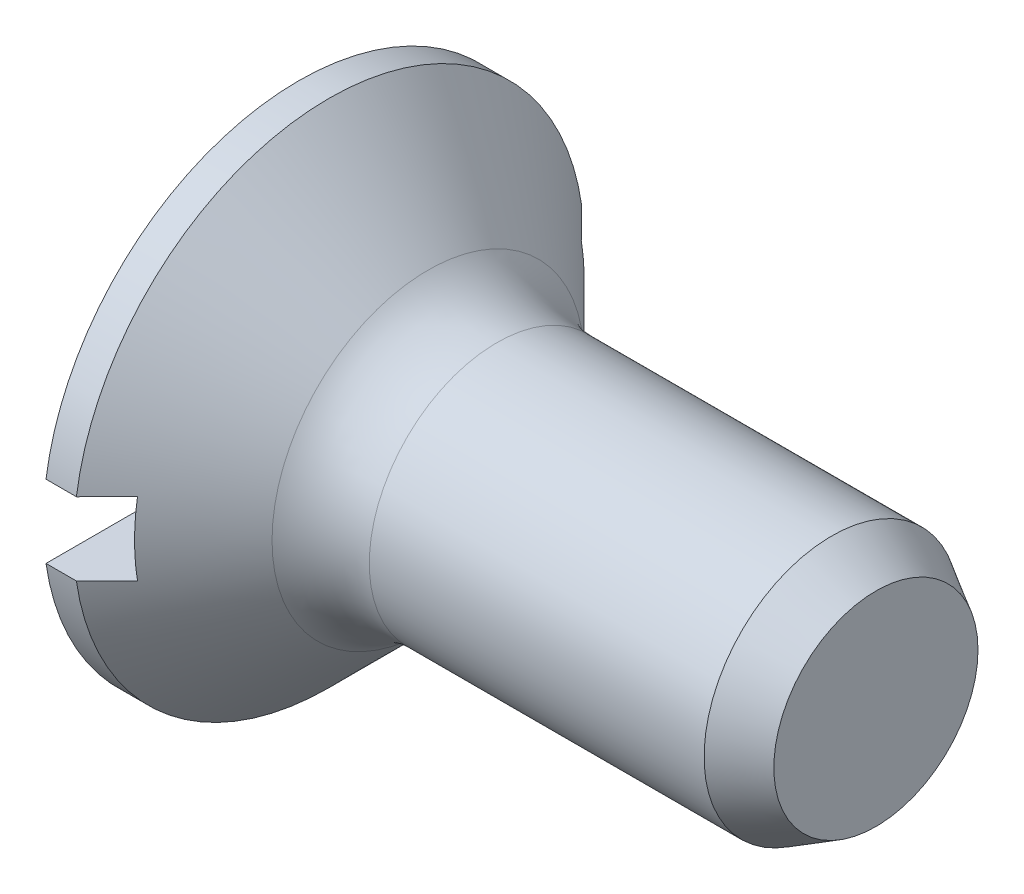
ISO-10303-21;
HEADER;
FILE_DESCRIPTION(('STEP AP214'),'2;1');
FILE_NAME('part.step','',(''),(''),'','','');
FILE_SCHEMA(('AUTOMOTIVE_DESIGN { 1 0 10303 214 1 1 1 1 }'));
ENDSEC;
DATA;
#1=APPLICATION_CONTEXT('core data for automotive mechanical design processes');
#2=APPLICATION_PROTOCOL_DEFINITION('international standard','automotive_design',2000,#1);
#3=PRODUCT_CONTEXT('',#1,'mechanical');
#4=PRODUCT('Part','Part','',(#3));
#5=PRODUCT_RELATED_PRODUCT_CATEGORY('part','',(#4));
#6=PRODUCT_DEFINITION_FORMATION('','',#4);
#7=PRODUCT_DEFINITION_CONTEXT('part definition',#1,'design');
#8=PRODUCT_DEFINITION('design','',#6,#7);
#9=PRODUCT_DEFINITION_SHAPE('','',#8);
#10=(LENGTH_UNIT() NAMED_UNIT(*) SI_UNIT(.MILLI.,.METRE.));
#11=(NAMED_UNIT(*) PLANE_ANGLE_UNIT() SI_UNIT($,.RADIAN.));
#12=(NAMED_UNIT(*) SI_UNIT($,.STERADIAN.) SOLID_ANGLE_UNIT());
#13=UNCERTAINTY_MEASURE_WITH_UNIT(LENGTH_MEASURE(1.E-05),#10,'distance_accuracy_value','');
#14=(GEOMETRIC_REPRESENTATION_CONTEXT(3) GLOBAL_UNCERTAINTY_ASSIGNED_CONTEXT((#13)) GLOBAL_UNIT_ASSIGNED_CONTEXT((#10,
#11,#12)) REPRESENTATION_CONTEXT('',''));
#15=CARTESIAN_POINT('',(0.,0.,0.));
#16=DIRECTION('',(0.,0.,1.));
#17=DIRECTION('',(1.,0.,0.));
#18=AXIS2_PLACEMENT_3D('',#15,#16,#17);
#19=CARTESIAN_POINT('',(0.,0.,0.));
#20=DIRECTION('',(-1.,0.,0.));
#21=DIRECTION('',(0.,0.,1.));
#22=AXIS2_PLACEMENT_3D('',#19,#20,#21);
#23=PLANE('',#22);
#24=DIRECTION('',(0.,0.,1.));
#25=VECTOR('',#24,1.);
#26=CARTESIAN_POINT('',(0.,0.6,-4.2));
#27=LINE('',#26,#25);
#28=CARTESIAN_POINT('',(0.,0.6,-4.15692193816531));
#29=VERTEX_POINT('',#28);
#30=CARTESIAN_POINT('',(0.,0.6,4.15692193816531));
#31=VERTEX_POINT('',#30);
#32=EDGE_CURVE('E178',#29,#31,#27,.T.);
#33=ORIENTED_EDGE('',*,*,#32,.T.);
#34=CARTESIAN_POINT('',(0.,0.,0.));
#35=DIRECTION('',(1.,0.,0.));
#36=DIRECTION('',(0.,0.,-1.));
#37=AXIS2_PLACEMENT_3D('',#34,#35,#36);
#38=CIRCLE('',#37,4.2);
#39=EDGE_CURVE('E115',#29,#31,#38,.T.);
#40=ORIENTED_EDGE('',*,*,#39,.F.);
#41=EDGE_LOOP('',(#33,#40));
#42=FACE_BOUND('',#41,.T.);
#43=ADVANCED_FACE('F35',(#42),#23,.T.);
#44=CARTESIAN_POINT('',(6.62068469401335,0.,0.));
#45=DIRECTION('',(1.,0.,0.));
#46=DIRECTION('',(0.,0.,-1.));
#47=AXIS2_PLACEMENT_3D('',#44,#45,#46);
#48=CYLINDRICAL_SURFACE('',#47,4.2);
#49=DIRECTION('',(1.,0.,0.));
#50=VECTOR('',#49,1.);
#51=CARTESIAN_POINT('',(6.62068469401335,0.6,4.15692193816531));
#52=LINE('',#51,#50);
#53=CARTESIAN_POINT('',(0.499999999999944,0.6,4.15692193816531));
#54=VERTEX_POINT('',#53);
#55=EDGE_CURVE('E175',#54,#31,#52,.F.);
#56=ORIENTED_EDGE('',*,*,#55,.F.);
#57=CARTESIAN_POINT('',(0.499999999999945,0.,0.));
#58=DIRECTION('',(1.,0.,0.));
#59=DIRECTION('',(0.,0.,-1.));
#60=AXIS2_PLACEMENT_3D('',#57,#58,#59);
#61=CIRCLE('',#60,4.2);
#62=CARTESIAN_POINT('',(0.499999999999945,0.6,-4.15692193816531));
#63=VERTEX_POINT('',#62);
#64=EDGE_CURVE('E170',#63,#54,#61,.T.);
#65=ORIENTED_EDGE('',*,*,#64,.F.);
#66=DIRECTION('',(1.,0.,0.));
#67=VECTOR('',#66,1.);
#68=CARTESIAN_POINT('',(6.62068469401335,0.6,-4.15692193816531));
#69=LINE('',#68,#67);
#70=EDGE_CURVE('E58',#29,#63,#69,.T.);
#71=ORIENTED_EDGE('',*,*,#70,.F.);
#72=ORIENTED_EDGE('',*,*,#39,.T.);
#73=EDGE_LOOP('',(#56,#65,#71,#72));
#74=FACE_BOUND('',#73,.T.);
#75=ADVANCED_FACE('F150',(#74),#48,.T.);
#76=DIRECTION('',(0.,0.,1.));
#77=VECTOR('',#76,1.);
#78=CARTESIAN_POINT('',(0.,-0.6,-4.2));
#79=LINE('',#78,#77);
#80=CARTESIAN_POINT('',(0.,-0.6,-4.15692193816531));
#81=VERTEX_POINT('',#80);
#82=CARTESIAN_POINT('',(0.,-0.6,4.15692193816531));
#83=VERTEX_POINT('',#82);
#84=EDGE_CURVE('E106',#81,#83,#79,.T.);
#85=ORIENTED_EDGE('',*,*,#84,.F.);
#86=EDGE_CURVE('E118',#83,#81,#38,.T.);
#87=ORIENTED_EDGE('',*,*,#86,.F.);
#88=EDGE_LOOP('',(#85,#87));
#89=FACE_BOUND('',#88,.T.);
#90=ADVANCED_FACE('F153',(#89),#23,.T.);
#91=DIRECTION('',(1.,0.,0.));
#92=VECTOR('',#91,1.);
#93=CARTESIAN_POINT('',(6.62068469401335,-0.6,-4.15692193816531));
#94=LINE('',#93,#92);
#95=CARTESIAN_POINT('',(0.499999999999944,-0.6,-4.15692193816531));
#96=VERTEX_POINT('',#95);
#97=EDGE_CURVE('E169',#96,#81,#94,.F.);
#98=ORIENTED_EDGE('',*,*,#97,.F.);
#99=CARTESIAN_POINT('',(0.499999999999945,-0.6,4.15692193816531));
#100=VERTEX_POINT('',#99);
#101=EDGE_CURVE('E171',#100,#96,#61,.T.);
#102=ORIENTED_EDGE('',*,*,#101,.F.);
#103=DIRECTION('',(1.,0.,0.));
#104=VECTOR('',#103,1.);
#105=CARTESIAN_POINT('',(6.62068469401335,-0.6,4.15692193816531));
#106=LINE('',#105,#104);
#107=EDGE_CURVE('E89',#83,#100,#106,.T.);
#108=ORIENTED_EDGE('',*,*,#107,.F.);
#109=ORIENTED_EDGE('',*,*,#86,.T.);
#110=EDGE_LOOP('',(#98,#102,#108,#109));
#111=FACE_BOUND('',#110,.T.);
#112=ADVANCED_FACE('F145',(#111),#48,.T.);
#113=CARTESIAN_POINT('',(2.6,0.,0.));
#114=DIRECTION('',(-1.,0.,0.));
#115=DIRECTION('',(0.,0.,1.));
#116=AXIS2_PLACEMENT_3D('',#113,#114,#115);
#117=CONICAL_SURFACE('',#116,2.1,0.785398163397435);
#118=CARTESIAN_POINT('',(2.13137084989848,0.,0.));
#119=DIRECTION('',(-1.,0.,0.));
#120=DIRECTION('',(0.,0.,1.));
#121=AXIS2_PLACEMENT_3D('',#118,#119,#120);
#122=CIRCLE('',#121,2.56862915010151);
#123=CARTESIAN_POINT('',(2.13137084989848,0.,2.56862915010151));
#124=VERTEX_POINT('',#123);
#125=EDGE_CURVE('E11',#124,#124,#122,.T.);
#126=ORIENTED_EDGE('',*,*,#125,.T.);
#127=EDGE_LOOP('',(#126));
#128=FACE_BOUND('',#127,.T.);
#129=CARTESIAN_POINT('',(-4.5491206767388,0.6,-9.22963884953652));
#130=CARTESIAN_POINT('',(-4.23253510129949,0.6,-8.91237980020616));
#131=CARTESIAN_POINT('',(-3.91597899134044,0.6,-8.59509132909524));
#132=CARTESIAN_POINT('',(-3.28295728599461,0.6,-7.960411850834));
#133=CARTESIAN_POINT('',(-2.96649169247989,0.6,-7.64302084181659));
#134=CARTESIAN_POINT('',(-2.33355669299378,0.6,-7.00796624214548));
#135=CARTESIAN_POINT('',(-2.01708734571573,0.6,-6.69030259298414));
#136=CARTESIAN_POINT('',(-1.38435990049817,0.6,-6.05477691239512));
#137=CARTESIAN_POINT('',(-1.06810179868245,0.6,-5.73691488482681));
#138=CARTESIAN_POINT('',(-0.431399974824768,0.6,-5.09632747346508));
#139=CARTESIAN_POINT('',(-0.110960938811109,0.6,-4.773597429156));
#140=CARTESIAN_POINT('',(0.369249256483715,0.6,-4.28903913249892));
#141=CARTESIAN_POINT('',(0.529249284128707,0.6,-4.12743774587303));
#142=CARTESIAN_POINT('',(0.849029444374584,0.6,-3.8040193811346));
#143=CARTESIAN_POINT('',(1.00880957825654,0.6,-3.64220240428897));
#144=CARTESIAN_POINT('',(1.32800689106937,0.6,-3.31829769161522));
#145=CARTESIAN_POINT('',(1.48742415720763,0.6,-3.15621004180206));
#146=CARTESIAN_POINT('',(1.80576276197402,0.6,-2.83154128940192));
#147=CARTESIAN_POINT('',(1.9646840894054,0.6,-2.6689601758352));
#148=CARTESIAN_POINT('',(2.28168875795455,0.6,-2.34301277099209));
#149=CARTESIAN_POINT('',(2.43977218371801,0.6,-2.17964656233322));
#150=CARTESIAN_POINT('',(2.6757097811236,0.6,-1.9334639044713));
#151=CARTESIAN_POINT('',(2.75415630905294,0.6,-1.85121563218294));
#152=CARTESIAN_POINT('',(2.91046386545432,0.6,-1.68616509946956));
#153=CARTESIAN_POINT('',(2.98832490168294,0.6,-1.60336284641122));
#154=CARTESIAN_POINT('',(3.10768735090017,0.6,-1.47503564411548));
#155=CARTESIAN_POINT('',(3.14950794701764,0.6,-1.42980781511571));
#156=CARTESIAN_POINT('',(3.23280025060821,0.6,-1.33903017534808));
#157=CARTESIAN_POINT('',(3.2742719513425,0.6,-1.29348035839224));
#158=CARTESIAN_POINT('',(3.35672612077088,0.6,-1.20198987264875));
#159=CARTESIAN_POINT('',(3.39770887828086,0.6,-1.15604946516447));
#160=CARTESIAN_POINT('',(3.4790272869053,0.6,-1.06360374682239));
#161=CARTESIAN_POINT('',(3.51936296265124,0.6,-1.01709845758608));
#162=CARTESIAN_POINT('',(3.6169113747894,0.6,-0.902431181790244));
#163=CARTESIAN_POINT('',(3.67363917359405,0.6,-0.833849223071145));
#164=CARTESIAN_POINT('',(3.75618329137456,0.6,-0.728867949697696));
#165=CARTESIAN_POINT('',(3.7832938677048,0.6,-0.693493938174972));
#166=CARTESIAN_POINT('',(3.8362421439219,0.6,-0.621820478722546));
#167=CARTESIAN_POINT('',(3.86208011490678,0.6,-0.585521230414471));
#168=CARTESIAN_POINT('',(3.92074489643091,0.6,-0.498618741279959));
#169=CARTESIAN_POINT('',(3.95282224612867,0.6,-0.447486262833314));
#170=CARTESIAN_POINT('',(3.99632817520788,0.6,-0.368279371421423));
#171=CARTESIAN_POINT('',(4.01005305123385,0.6,-0.341480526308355));
#172=CARTESIAN_POINT('',(4.03537354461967,0.6,-0.286905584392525));
#173=CARTESIAN_POINT('',(4.04697070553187,0.6,-0.259130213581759));
#174=CARTESIAN_POINT('',(4.06975584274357,0.6,-0.195655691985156));
#175=CARTESIAN_POINT('',(4.08016729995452,0.6,-0.159664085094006));
#176=CARTESIAN_POINT('',(4.09484209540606,0.6,-0.0865108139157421));
#177=CARTESIAN_POINT('',(4.09912761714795,0.6,-0.0493538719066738));
#178=CARTESIAN_POINT('',(4.10063145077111,0.6,0.0253058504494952));
#179=CARTESIAN_POINT('',(4.09781328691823,0.6,0.0628094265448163));
#180=CARTESIAN_POINT('',(4.08570001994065,0.6,0.136790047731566));
#181=CARTESIAN_POINT('',(4.07638689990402,0.6,0.17326394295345));
#182=CARTESIAN_POINT('',(4.05258648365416,0.6,0.245675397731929));
#183=CARTESIAN_POINT('',(4.03794597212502,0.6,0.281560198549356));
#184=CARTESIAN_POINT('',(4.00519545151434,0.6,0.351736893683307));
#185=CARTESIAN_POINT('',(3.98707917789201,0.6,0.386025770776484));
#186=CARTESIAN_POINT('',(3.948387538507,0.6,0.453532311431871));
#187=CARTESIAN_POINT('',(3.92779340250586,0.6,0.486739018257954));
#188=CARTESIAN_POINT('',(3.88503168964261,0.6,0.552070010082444));
#189=CARTESIAN_POINT('',(3.86286546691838,0.6,0.584195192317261));
#190=CARTESIAN_POINT('',(3.81546285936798,0.6,0.650372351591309));
#191=CARTESIAN_POINT('',(3.79012643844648,0.6,0.684352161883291));
#192=CARTESIAN_POINT('',(3.73852197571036,0.6,0.751599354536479));
#193=CARTESIAN_POINT('',(3.71225380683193,0.6,0.78486663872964));
#194=CARTESIAN_POINT('',(3.63242245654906,0.6,0.883891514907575));
#195=CARTESIAN_POINT('',(3.57785720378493,0.6,0.948838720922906));
#196=CARTESIAN_POINT('',(3.46711095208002,0.6,1.07753116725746));
#197=CARTESIAN_POINT('',(3.41092716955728,0.6,1.14127398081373));
#198=CARTESIAN_POINT('',(3.29760744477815,0.6,1.26787232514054));
#199=CARTESIAN_POINT('',(3.24047178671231,0.6,1.33072811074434));
#200=CARTESIAN_POINT('',(3.12572715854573,0.6,1.45565823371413));
#201=CARTESIAN_POINT('',(3.06812011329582,0.6,1.51773434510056));
#202=CARTESIAN_POINT('',(2.95244883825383,0.6,1.64146716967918));
#203=CARTESIAN_POINT('',(2.89438457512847,0.6,1.70312385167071));
#204=CARTESIAN_POINT('',(2.71983498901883,0.6,1.88749460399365));
#205=CARTESIAN_POINT('',(2.60286399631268,0.6,2.00974841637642));
#206=CARTESIAN_POINT('',(2.36873896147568,0.6,2.25296205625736));
#207=CARTESIAN_POINT('',(2.25158842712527,0.6,2.37392527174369));
#208=CARTESIAN_POINT('',(2.01681446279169,0.6,2.6153922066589));
#209=CARTESIAN_POINT('',(1.89919103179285,0.6,2.73589592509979));
#210=CARTESIAN_POINT('',(1.5458509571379,0.6,3.09695691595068));
#211=CARTESIAN_POINT('',(1.30966947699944,0.6,3.33705891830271));
#212=CARTESIAN_POINT('',(0.836576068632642,0.6,3.81674801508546));
#213=CARTESIAN_POINT('',(0.599663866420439,0.6,4.05633483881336));
#214=CARTESIAN_POINT('',(0.125466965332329,0.6,4.53513506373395));
#215=CARTESIAN_POINT('',(-0.111817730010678,0.6,4.77434846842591));
#216=CARTESIAN_POINT('',(-0.586600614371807,0.6,5.25251809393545));
#217=CARTESIAN_POINT('',(-0.824098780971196,0.6,5.49147433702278));
#218=CARTESIAN_POINT('',(-1.29925582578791,0.6,5.96922814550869));
#219=CARTESIAN_POINT('',(-1.53691470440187,0.6,6.20802571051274));
#220=CARTESIAN_POINT('',(-2.2500048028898,0.6,6.924200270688));
#221=CARTESIAN_POINT('',(-2.72560201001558,0.6,7.40141198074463));
#222=CARTESIAN_POINT('',(-3.31361229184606,0.6,7.99112317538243));
#223=CARTESIAN_POINT('',(-3.42591266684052,0.6,8.10373509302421));
#224=CARTESIAN_POINT('',(-3.65052781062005,0.6,8.32894852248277));
#225=CARTESIAN_POINT('',(-3.76284257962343,0.6,8.44155003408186));
#226=CARTESIAN_POINT('',(-3.98747999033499,0.6,8.66673930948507));
#227=CARTESIAN_POINT('',(-4.09980263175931,0.6,8.77932707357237));
#228=CARTESIAN_POINT('',(-4.32445564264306,0.6,9.00449093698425));
#229=CARTESIAN_POINT('',(-4.43678601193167,0.6,9.11706703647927));
#230=CARTESIAN_POINT('',(-4.5491206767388,0.6,9.22963884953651));
#231=B_SPLINE_CURVE_WITH_KNOTS('',3,(#129,#130,#131,#132,#133,#134,#135,#136,#137,#138,#139,
#140,#141,#142,#143,#144,#145,#146,#147,#148,#149,#150,#151,#152,#153,#154,#155,#156,#157,#158,
#159,#160,#161,#162,#163,#164,#165,#166,#167,#168,#169,#170,#171,#172,#173,#174,#175,#176,#177,
#178,#179,#180,#181,#182,#183,#184,#185,#186,#187,#188,#189,#190,#191,#192,#193,#194,#195,#196,
#197,#198,#199,#200,#201,#202,#203,#204,#205,#206,#207,#208,#209,#210,#211,#212,#213,#214,#215,
#216,#217,#218,#219,#220,#221,#222,#223,#224,#225,#226,#227,#228,#229,#230),.UNSPECIFIED.,.F.,
.F.,(4,2,2,2,2,2,2,2,2,2,2,2,2,2,2,2,2,2,2,2,2,2,2,2,2,2,2,2,2,2,2,2,2,2,2,2,2,2,2,2,2,2,2,2,2,
2,2,2,2,2,4),(0.,1.34458827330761,2.68920259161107,4.03440413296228,5.37958027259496,
6.74395604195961,7.42618397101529,8.10840790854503,8.79044552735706,9.47249843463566,
10.1544810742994,10.4954600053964,10.8364344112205,11.0212319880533,11.2060331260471,
11.3907190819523,11.5753979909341,11.8423342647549,11.976014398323,12.1096659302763,
12.290459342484,12.3807179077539,12.4709107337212,12.5829050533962,12.6944927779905,
12.8066546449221,12.9191288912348,13.0351330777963,13.151348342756,13.2685071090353,
13.3855661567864,13.5127011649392,13.6398535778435,13.8942830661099,14.1491798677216,
14.4040018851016,14.6580623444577,14.912141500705,15.4197311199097,15.9249100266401,
16.4300900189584,17.4404713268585,18.4512939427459,19.4621070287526,20.4728241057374,
21.4835436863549,23.5047593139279,23.9818707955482,24.4589906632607,24.9360980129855,
25.4131969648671),.UNSPECIFIED.);
#232=CARTESIAN_POINT('',(1.,0.6,3.65102725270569));
#233=VERTEX_POINT('',#232);
#234=EDGE_CURVE('E111',#233,#54,#231,.T.);
#235=ORIENTED_EDGE('',*,*,#234,.F.);
#236=CARTESIAN_POINT('',(1.,0.,0.));
#237=DIRECTION('',(1.,0.,0.));
#238=DIRECTION('',(0.,0.,-1.));
#239=AXIS2_PLACEMENT_3D('',#236,#237,#238);
#240=CIRCLE('',#239,3.69999999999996);
#241=CARTESIAN_POINT('',(1.,-0.6,3.65102725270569));
#242=VERTEX_POINT('',#241);
#243=EDGE_CURVE('E94',#242,#233,#240,.F.);
#244=ORIENTED_EDGE('',*,*,#243,.F.);
#245=CARTESIAN_POINT('',(-4.5491206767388,-0.6,9.22963884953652));
#246=CARTESIAN_POINT('',(-4.23253510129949,-0.6,8.91237980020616));
#247=CARTESIAN_POINT('',(-3.91597899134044,-0.6,8.59509132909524));
#248=CARTESIAN_POINT('',(-3.28295728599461,-0.6,7.960411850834));
#249=CARTESIAN_POINT('',(-2.96649169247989,-0.6,7.64302084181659));
#250=CARTESIAN_POINT('',(-2.33355669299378,-0.6,7.00796624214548));
#251=CARTESIAN_POINT('',(-2.01708734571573,-0.6,6.69030259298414));
#252=CARTESIAN_POINT('',(-1.38435990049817,-0.6,6.05477691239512));
#253=CARTESIAN_POINT('',(-1.06810179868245,-0.6,5.73691488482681));
#254=CARTESIAN_POINT('',(-0.431399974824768,-0.6,5.09632747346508));
#255=CARTESIAN_POINT('',(-0.110960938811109,-0.6,4.773597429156));
#256=CARTESIAN_POINT('',(0.369249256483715,-0.6,4.28903913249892));
#257=CARTESIAN_POINT('',(0.529249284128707,-0.6,4.12743774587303));
#258=CARTESIAN_POINT('',(0.849029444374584,-0.6,3.8040193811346));
#259=CARTESIAN_POINT('',(1.00880957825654,-0.6,3.64220240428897));
#260=CARTESIAN_POINT('',(1.32800689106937,-0.6,3.31829769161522));
#261=CARTESIAN_POINT('',(1.48742415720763,-0.6,3.15621004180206));
#262=CARTESIAN_POINT('',(1.80576276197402,-0.6,2.83154128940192));
#263=CARTESIAN_POINT('',(1.9646840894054,-0.6,2.6689601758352));
#264=CARTESIAN_POINT('',(2.28168875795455,-0.6,2.34301277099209));
#265=CARTESIAN_POINT('',(2.43977218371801,-0.6,2.17964656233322));
#266=CARTESIAN_POINT('',(2.6757097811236,-0.6,1.9334639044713));
#267=CARTESIAN_POINT('',(2.75415630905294,-0.6,1.85121563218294));
#268=CARTESIAN_POINT('',(2.91046386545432,-0.6,1.68616509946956));
#269=CARTESIAN_POINT('',(2.98832490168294,-0.6,1.60336284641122));
#270=CARTESIAN_POINT('',(3.10768735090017,-0.6,1.47503564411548));
#271=CARTESIAN_POINT('',(3.14950794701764,-0.6,1.42980781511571));
#272=CARTESIAN_POINT('',(3.23280025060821,-0.6,1.33903017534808));
#273=CARTESIAN_POINT('',(3.2742719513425,-0.6,1.29348035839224));
#274=CARTESIAN_POINT('',(3.35672612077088,-0.6,1.20198987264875));
#275=CARTESIAN_POINT('',(3.39770887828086,-0.6,1.15604946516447));
#276=CARTESIAN_POINT('',(3.4790272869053,-0.6,1.06360374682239));
#277=CARTESIAN_POINT('',(3.51936296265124,-0.6,1.01709845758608));
#278=CARTESIAN_POINT('',(3.6169113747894,-0.6,0.902431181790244));
#279=CARTESIAN_POINT('',(3.67363917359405,-0.6,0.833849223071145));
#280=CARTESIAN_POINT('',(3.75618329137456,-0.6,0.728867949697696));
#281=CARTESIAN_POINT('',(3.7832938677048,-0.6,0.693493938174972));
#282=CARTESIAN_POINT('',(3.8362421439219,-0.6,0.621820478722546));
#283=CARTESIAN_POINT('',(3.86208011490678,-0.6,0.585521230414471));
#284=CARTESIAN_POINT('',(3.92074489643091,-0.6,0.498618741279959));
#285=CARTESIAN_POINT('',(3.95282224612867,-0.6,0.447486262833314));
#286=CARTESIAN_POINT('',(3.99632817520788,-0.6,0.368279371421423));
#287=CARTESIAN_POINT('',(4.01005305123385,-0.6,0.341480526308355));
#288=CARTESIAN_POINT('',(4.03537354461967,-0.6,0.286905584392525));
#289=CARTESIAN_POINT('',(4.04697070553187,-0.6,0.259130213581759));
#290=CARTESIAN_POINT('',(4.06975584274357,-0.6,0.195655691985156));
#291=CARTESIAN_POINT('',(4.08016729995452,-0.6,0.159664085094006));
#292=CARTESIAN_POINT('',(4.09484209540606,-0.6,0.0865108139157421));
#293=CARTESIAN_POINT('',(4.09912761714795,-0.6,0.0493538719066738));
#294=CARTESIAN_POINT('',(4.10063145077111,-0.6,-0.0253058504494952));
#295=CARTESIAN_POINT('',(4.09781328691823,-0.6,-0.0628094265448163));
#296=CARTESIAN_POINT('',(4.08570001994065,-0.6,-0.136790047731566));
#297=CARTESIAN_POINT('',(4.07638689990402,-0.6,-0.17326394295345));
#298=CARTESIAN_POINT('',(4.05258648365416,-0.6,-0.245675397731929));
#299=CARTESIAN_POINT('',(4.03794597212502,-0.6,-0.281560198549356));
#300=CARTESIAN_POINT('',(4.00519545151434,-0.6,-0.351736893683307));
#301=CARTESIAN_POINT('',(3.98707917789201,-0.6,-0.386025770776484));
#302=CARTESIAN_POINT('',(3.948387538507,-0.6,-0.453532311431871));
#303=CARTESIAN_POINT('',(3.92779340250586,-0.6,-0.486739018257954));
#304=CARTESIAN_POINT('',(3.88503168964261,-0.6,-0.552070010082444));
#305=CARTESIAN_POINT('',(3.86286546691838,-0.6,-0.584195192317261));
#306=CARTESIAN_POINT('',(3.81546285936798,-0.6,-0.650372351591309));
#307=CARTESIAN_POINT('',(3.79012643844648,-0.6,-0.684352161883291));
#308=CARTESIAN_POINT('',(3.73852197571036,-0.6,-0.751599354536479));
#309=CARTESIAN_POINT('',(3.71225380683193,-0.6,-0.78486663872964));
#310=CARTESIAN_POINT('',(3.63242245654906,-0.6,-0.883891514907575));
#311=CARTESIAN_POINT('',(3.57785720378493,-0.6,-0.948838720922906));
#312=CARTESIAN_POINT('',(3.46711095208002,-0.6,-1.07753116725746));
#313=CARTESIAN_POINT('',(3.41092716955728,-0.6,-1.14127398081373));
#314=CARTESIAN_POINT('',(3.29760744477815,-0.6,-1.26787232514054));
#315=CARTESIAN_POINT('',(3.24047178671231,-0.6,-1.33072811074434));
#316=CARTESIAN_POINT('',(3.12572715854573,-0.6,-1.45565823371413));
#317=CARTESIAN_POINT('',(3.06812011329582,-0.6,-1.51773434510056));
#318=CARTESIAN_POINT('',(2.95244883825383,-0.6,-1.64146716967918));
#319=CARTESIAN_POINT('',(2.89438457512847,-0.6,-1.70312385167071));
#320=CARTESIAN_POINT('',(2.71983498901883,-0.6,-1.88749460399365));
#321=CARTESIAN_POINT('',(2.60286399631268,-0.6,-2.00974841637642));
#322=CARTESIAN_POINT('',(2.36873896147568,-0.6,-2.25296205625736));
#323=CARTESIAN_POINT('',(2.25158842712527,-0.6,-2.37392527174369));
#324=CARTESIAN_POINT('',(2.01681446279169,-0.6,-2.6153922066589));
#325=CARTESIAN_POINT('',(1.89919103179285,-0.6,-2.73589592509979));
#326=CARTESIAN_POINT('',(1.5458509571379,-0.6,-3.09695691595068));
#327=CARTESIAN_POINT('',(1.30966947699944,-0.6,-3.33705891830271));
#328=CARTESIAN_POINT('',(0.836576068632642,-0.6,-3.81674801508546));
#329=CARTESIAN_POINT('',(0.599663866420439,-0.6,-4.05633483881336));
#330=CARTESIAN_POINT('',(0.125466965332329,-0.6,-4.53513506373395));
#331=CARTESIAN_POINT('',(-0.111817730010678,-0.6,-4.77434846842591));
#332=CARTESIAN_POINT('',(-0.586600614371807,-0.6,-5.25251809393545));
#333=CARTESIAN_POINT('',(-0.824098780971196,-0.6,-5.49147433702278));
#334=CARTESIAN_POINT('',(-1.29925582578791,-0.6,-5.96922814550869));
#335=CARTESIAN_POINT('',(-1.53691470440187,-0.6,-6.20802571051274));
#336=CARTESIAN_POINT('',(-2.2500048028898,-0.6,-6.924200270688));
#337=CARTESIAN_POINT('',(-2.72560201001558,-0.6,-7.40141198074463));
#338=CARTESIAN_POINT('',(-3.31361229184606,-0.6,-7.99112317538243));
#339=CARTESIAN_POINT('',(-3.42591266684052,-0.6,-8.10373509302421));
#340=CARTESIAN_POINT('',(-3.65052781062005,-0.6,-8.32894852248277));
#341=CARTESIAN_POINT('',(-3.76284257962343,-0.6,-8.44155003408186));
#342=CARTESIAN_POINT('',(-3.98747999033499,-0.6,-8.66673930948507));
#343=CARTESIAN_POINT('',(-4.09980263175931,-0.6,-8.77932707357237));
#344=CARTESIAN_POINT('',(-4.32445564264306,-0.6,-9.00449093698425));
#345=CARTESIAN_POINT('',(-4.43678601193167,-0.6,-9.11706703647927));
#346=CARTESIAN_POINT('',(-4.5491206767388,-0.6,-9.22963884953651));
#347=B_SPLINE_CURVE_WITH_KNOTS('',3,(#245,#246,#247,#248,#249,#250,#251,#252,#253,#254,#255,
#256,#257,#258,#259,#260,#261,#262,#263,#264,#265,#266,#267,#268,#269,#270,#271,#272,#273,#274,
#275,#276,#277,#278,#279,#280,#281,#282,#283,#284,#285,#286,#287,#288,#289,#290,#291,#292,#293,
#294,#295,#296,#297,#298,#299,#300,#301,#302,#303,#304,#305,#306,#307,#308,#309,#310,#311,#312,
#313,#314,#315,#316,#317,#318,#319,#320,#321,#322,#323,#324,#325,#326,#327,#328,#329,#330,#331,
#332,#333,#334,#335,#336,#337,#338,#339,#340,#341,#342,#343,#344,#345,#346),.UNSPECIFIED.,.F.,
.F.,(4,2,2,2,2,2,2,2,2,2,2,2,2,2,2,2,2,2,2,2,2,2,2,2,2,2,2,2,2,2,2,2,2,2,2,2,2,2,2,2,2,2,2,2,2,
2,2,2,2,2,4),(0.,1.34458827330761,2.68920259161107,4.03440413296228,5.37958027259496,
6.74395604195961,7.42618397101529,8.10840790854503,8.79044552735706,9.47249843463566,
10.1544810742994,10.4954600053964,10.8364344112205,11.0212319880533,11.2060331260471,
11.3907190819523,11.5753979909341,11.8423342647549,11.976014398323,12.1096659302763,
12.290459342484,12.3807179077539,12.4709107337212,12.5829050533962,12.6944927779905,
12.8066546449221,12.9191288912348,13.0351330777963,13.151348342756,13.2685071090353,
13.3855661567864,13.5127011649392,13.6398535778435,13.8942830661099,14.1491798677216,
14.4040018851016,14.6580623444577,14.912141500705,15.4197311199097,15.9249100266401,
16.4300900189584,17.4404713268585,18.4512939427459,19.4621070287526,20.4728241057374,
21.4835436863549,23.5047593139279,23.9818707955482,24.4589906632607,24.9360980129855,
25.4131969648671),.UNSPECIFIED.);
#348=EDGE_CURVE('E86',#100,#242,#347,.T.);
#349=ORIENTED_EDGE('',*,*,#348,.F.);
#350=ORIENTED_EDGE('',*,*,#101,.T.);
#351=CARTESIAN_POINT('',(1.,-0.6,-3.65102725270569));
#352=VERTEX_POINT('',#351);
#353=EDGE_CURVE('E97',#352,#96,#347,.T.);
#354=ORIENTED_EDGE('',*,*,#353,.F.);
#355=CARTESIAN_POINT('',(1.,0.6,-3.65102725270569));
#356=VERTEX_POINT('',#355);
#357=EDGE_CURVE('E103',#356,#352,#240,.F.);
#358=ORIENTED_EDGE('',*,*,#357,.F.);
#359=EDGE_CURVE('E95',#63,#356,#231,.T.);
#360=ORIENTED_EDGE('',*,*,#359,.F.);
#361=ORIENTED_EDGE('',*,*,#64,.T.);
#362=EDGE_LOOP('',(#235,#244,#349,#350,#354,#358,#360,#361));
#363=FACE_BOUND('',#362,.T.);
#364=ADVANCED_FACE('F109',(#128,#363),#117,.T.);
#365=CARTESIAN_POINT('',(6.62068469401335,0.,0.));
#366=DIRECTION('',(1.,0.,0.));
#367=DIRECTION('',(0.,0.,-1.));
#368=AXIS2_PLACEMENT_3D('',#365,#366,#367);
#369=CYLINDRICAL_SURFACE('',#368,2.1);
#370=CARTESIAN_POINT('',(3.26274169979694,0.,0.));
#371=DIRECTION('',(1.,0.,0.));
#372=DIRECTION('',(0.,0.,-1.));
#373=AXIS2_PLACEMENT_3D('',#370,#371,#372);
#374=CIRCLE('',#373,2.1);
#375=CARTESIAN_POINT('',(3.26274169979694,0.,-2.1));
#376=VERTEX_POINT('',#375);
#377=EDGE_CURVE('E43',#376,#376,#374,.T.);
#378=ORIENTED_EDGE('',*,*,#377,.T.);
#379=EDGE_LOOP('',(#378));
#380=FACE_BOUND('',#379,.T.);
#381=CARTESIAN_POINT('',(8.77253866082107,0.,0.));
#382=DIRECTION('',(1.,0.,0.));
#383=DIRECTION('',(0.,0.,-1.));
#384=AXIS2_PLACEMENT_3D('',#381,#382,#383);
#385=CIRCLE('',#384,2.1);
#386=CARTESIAN_POINT('',(8.77253866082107,0.,-2.1));
#387=VERTEX_POINT('',#386);
#388=EDGE_CURVE('E194',#387,#387,#385,.F.);
#389=ORIENTED_EDGE('',*,*,#388,.T.);
#390=EDGE_LOOP('',(#389));
#391=FACE_BOUND('',#390,.T.);
#392=ADVANCED_FACE('F138',(#380,#391),#369,.T.);
#393=CARTESIAN_POINT('',(9.5,2.1,0.));
#394=DIRECTION('',(1.,0.,0.));
#395=DIRECTION('',(0.,0.,-1.));
#396=AXIS2_PLACEMENT_3D('',#393,#394,#395);
#397=PLANE('',#396);
#398=CARTESIAN_POINT('',(9.5,0.,0.));
#399=DIRECTION('',(1.,0.,0.));
#400=DIRECTION('',(0.,0.,-1.));
#401=AXIS2_PLACEMENT_3D('',#398,#399,#400);
#402=CIRCLE('',#401,1.68);
#403=CARTESIAN_POINT('',(9.5,0.,-1.68));
#404=VERTEX_POINT('',#403);
#405=EDGE_CURVE('E113',#404,#404,#402,.T.);
#406=ORIENTED_EDGE('',*,*,#405,.T.);
#407=EDGE_LOOP('',(#406));
#408=FACE_BOUND('',#407,.T.);
#409=ADVANCED_FACE('F135',(#408),#397,.T.);
#410=CARTESIAN_POINT('',(0.,0.6,-4.2));
#411=DIRECTION('',(0.,1.,0.));
#412=DIRECTION('',(0.,0.,1.));
#413=AXIS2_PLACEMENT_3D('',#410,#411,#412);
#414=PLANE('',#413);
#415=ORIENTED_EDGE('',*,*,#70,.T.);
#416=ORIENTED_EDGE('',*,*,#359,.T.);
#417=DIRECTION('',(0.,0.,1.));
#418=VECTOR('',#417,1.);
#419=CARTESIAN_POINT('',(1.,0.6,-4.2));
#420=LINE('',#419,#418);
#421=EDGE_CURVE('E105',#356,#233,#420,.T.);
#422=ORIENTED_EDGE('',*,*,#421,.T.);
#423=ORIENTED_EDGE('',*,*,#234,.T.);
#424=ORIENTED_EDGE('',*,*,#55,.T.);
#425=ORIENTED_EDGE('',*,*,#32,.F.);
#426=EDGE_LOOP('',(#415,#416,#422,#423,#424,#425));
#427=FACE_BOUND('',#426,.T.);
#428=ADVANCED_FACE('F137',(#427),#414,.F.);
#429=CARTESIAN_POINT('',(1.,0.6,-4.2));
#430=DIRECTION('',(1.,0.,0.));
#431=DIRECTION('',(0.,0.,-1.));
#432=AXIS2_PLACEMENT_3D('',#429,#430,#431);
#433=PLANE('',#432);
#434=ORIENTED_EDGE('',*,*,#243,.T.);
#435=ORIENTED_EDGE('',*,*,#421,.F.);
#436=ORIENTED_EDGE('',*,*,#357,.T.);
#437=DIRECTION('',(0.,0.,1.));
#438=VECTOR('',#437,1.);
#439=CARTESIAN_POINT('',(1.,-0.6,-4.2));
#440=LINE('',#439,#438);
#441=EDGE_CURVE('E50',#352,#242,#440,.T.);
#442=ORIENTED_EDGE('',*,*,#441,.T.);
#443=EDGE_LOOP('',(#434,#435,#436,#442));
#444=FACE_BOUND('',#443,.T.);
#445=ADVANCED_FACE('F99',(#444),#433,.F.);
#446=CARTESIAN_POINT('',(0.,-0.6,-4.2));
#447=DIRECTION('',(0.,-1.,0.));
#448=DIRECTION('',(0.,0.,-1.));
#449=AXIS2_PLACEMENT_3D('',#446,#447,#448);
#450=PLANE('',#449);
#451=ORIENTED_EDGE('',*,*,#107,.T.);
#452=ORIENTED_EDGE('',*,*,#348,.T.);
#453=ORIENTED_EDGE('',*,*,#441,.F.);
#454=ORIENTED_EDGE('',*,*,#353,.T.);
#455=ORIENTED_EDGE('',*,*,#97,.T.);
#456=ORIENTED_EDGE('',*,*,#84,.T.);
#457=EDGE_LOOP('',(#451,#452,#453,#454,#455,#456));
#458=FACE_BOUND('',#457,.T.);
#459=ADVANCED_FACE('F87',(#458),#450,.F.);
#460=CARTESIAN_POINT('',(9.5,0.,0.));
#461=DIRECTION('',(-1.,0.,0.));
#462=DIRECTION('',(0.,0.,1.));
#463=AXIS2_PLACEMENT_3D('',#460,#461,#462);
#464=CONICAL_SURFACE('',#463,1.68,0.523598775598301);
#465=ORIENTED_EDGE('',*,*,#388,.F.);
#466=EDGE_LOOP('',(#465));
#467=FACE_BOUND('',#466,.T.);
#468=ORIENTED_EDGE('',*,*,#405,.F.);
#469=EDGE_LOOP('',(#468));
#470=FACE_BOUND('',#469,.T.);
#471=ADVANCED_FACE('F133',(#467,#470),#464,.T.);
#472=CARTESIAN_POINT('',(3.26274169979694,0.,0.));
#473=DIRECTION('',(1.,0.,0.));
#474=DIRECTION('',(0.,0.,-1.));
#475=AXIS2_PLACEMENT_3D('',#472,#473,#474);
#476=TOROIDAL_SURFACE('',#475,3.7,1.6);
#477=ORIENTED_EDGE('',*,*,#125,.F.);
#478=EDGE_LOOP('',(#477));
#479=FACE_BOUND('',#478,.T.);
#480=ORIENTED_EDGE('',*,*,#377,.F.);
#481=EDGE_LOOP('',(#480));
#482=FACE_BOUND('',#481,.T.);
#483=ADVANCED_FACE('F37',(#479,#482),#476,.F.);
#484=CLOSED_SHELL('',(#43,#75,#90,#112,#364,#392,#409,#428,#445,#459,#471,#483));
#485=MANIFOLD_SOLID_BREP('B2',#484);
#486=ADVANCED_BREP_SHAPE_REPRESENTATION('',(#18,#485),#14);
#487=SHAPE_DEFINITION_REPRESENTATION(#9,#486);
ENDSEC;
END-ISO-10303-21;
